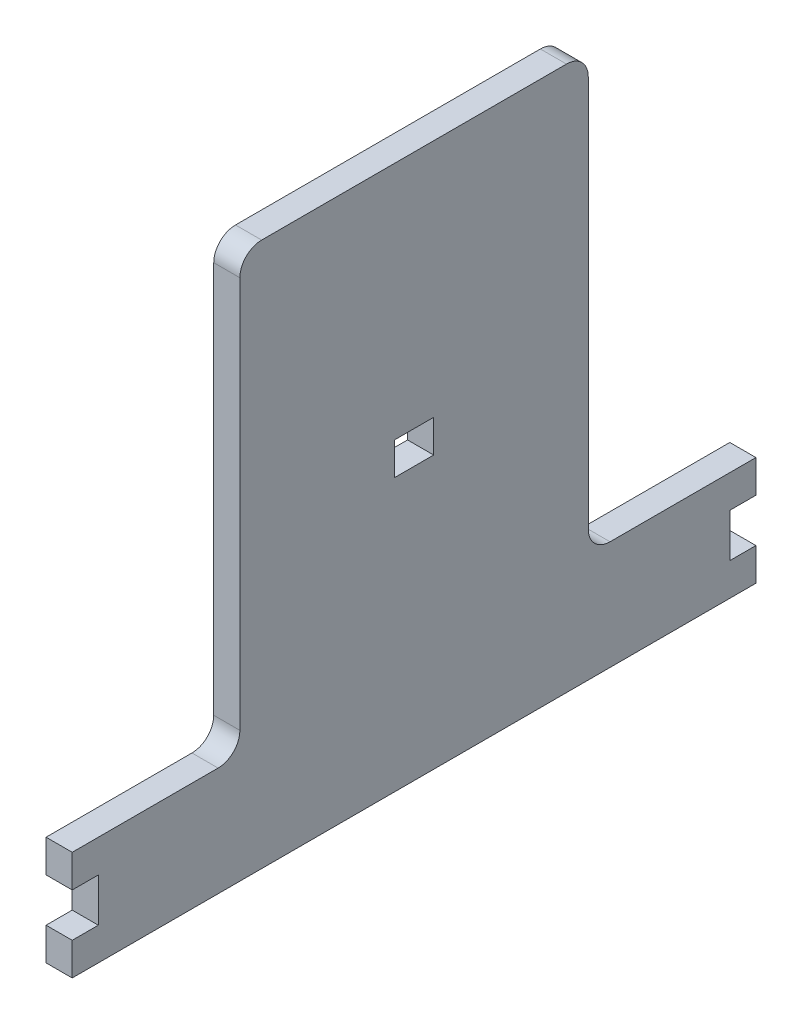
from build123d import *

# Parameters (mm, degrees)
BOSS_EXTRUDE1_DEPTH = 12
SKETCH2_R           = 4.7
CUT_EXTRUDE1_DEPTH  = 5
SKETCH3_W           = 18
SKETCH3_H           = 15
CUT_EXTRUDE2_DEPTH  = 15
FILLET1_R           = 10


with BuildPart() as part:
    # Sketch1 → Boss-Extrude1 (new body)
    with BuildSketch(Plane(origin=(0, 0, 0), x_dir=(0, 0, -1), z_dir=(1, 0, 0))):
        Polygon((-157, 25), (-157, 10), (-145, 10), (-145, -10), (-157, -10), (-157, -25), (157, -25), (157, -10), (145, -10), (145, 10), (157, 10), (157, 25), (80, 25), (80, 225), (-80, 225), (-80, 25), align=None)
    extrude(amount=-BOSS_EXTRUDE1_DEPTH)

    # Sketch2 → Cut-Extrude1 (cut)
    with BuildSketch(Plane.ZY.offset(12)):
        with Locations((-60.3, 129.7)):
            Circle(SKETCH2_R)
        with Locations((60.3, 129.7)):
            Circle(SKETCH2_R)
    extrude(amount=-CUT_EXTRUDE1_DEPTH, mode=Mode.SUBTRACT)

    # Sketch3 → Cut-Extrude2 (cut)
    with BuildSketch(Plane.ZY.offset(12)):
        with Locations((0, 107.5)):
            Rectangle(SKETCH3_W, SKETCH3_H)
    extrude(amount=-CUT_EXTRUDE2_DEPTH, mode=Mode.SUBTRACT)

    # Fillet1
    fillet1_edges = [part.edges().sort_by_distance(p)[0] for p in [
        (-6, 25, 80),
        (-6, 225, 80),
        (-6, 225, -80),
        (-6, 25, -80),
    ]]
    fillet(fillet1_edges, radius=FILLET1_R)


solid = part.part
